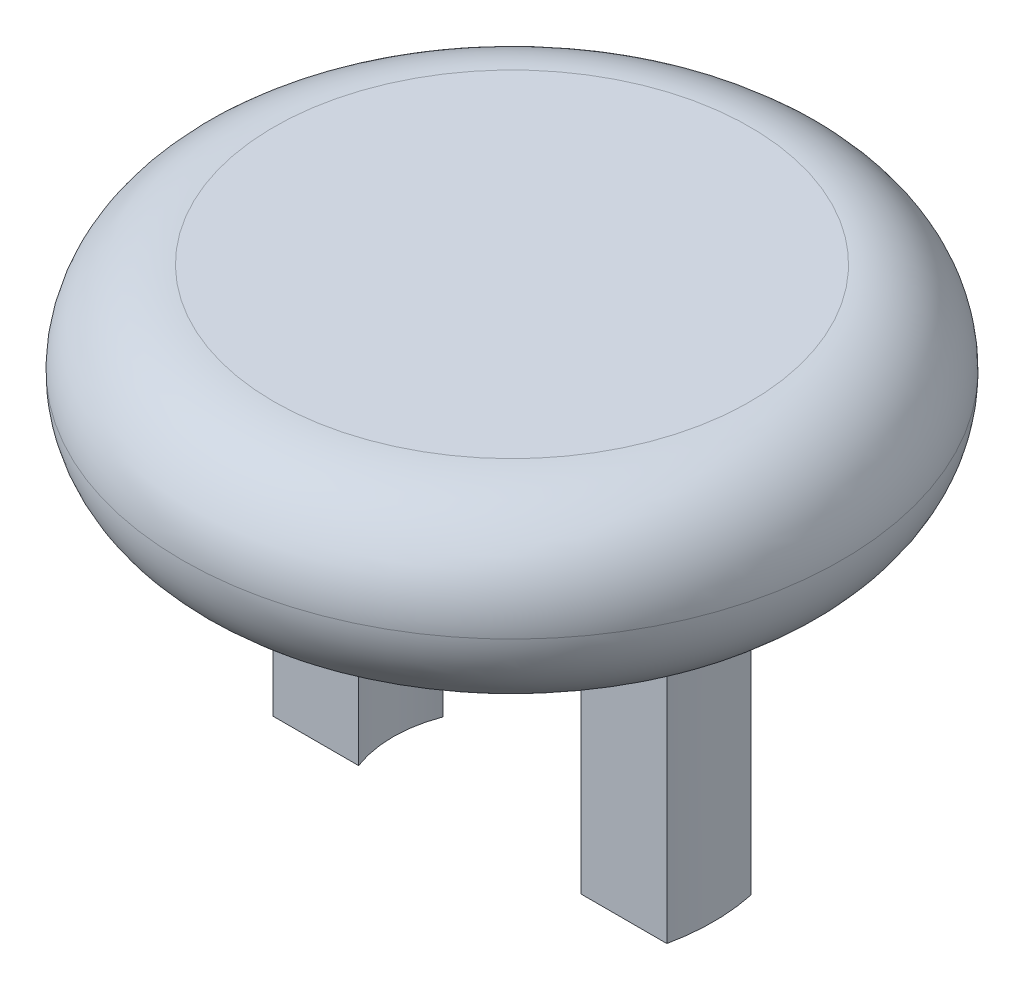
ISO-10303-21;
HEADER;
FILE_DESCRIPTION(('STEP AP214'),'2;1');
FILE_NAME('part.step','',(''),(''),'','','');
FILE_SCHEMA(('AUTOMOTIVE_DESIGN { 1 0 10303 214 1 1 1 1 }'));
ENDSEC;
DATA;
#1=APPLICATION_CONTEXT('core data for automotive mechanical design processes');
#2=APPLICATION_PROTOCOL_DEFINITION('international standard','automotive_design',2000,#1);
#3=PRODUCT_CONTEXT('',#1,'mechanical');
#4=PRODUCT('Part','Part','',(#3));
#5=PRODUCT_RELATED_PRODUCT_CATEGORY('part','',(#4));
#6=PRODUCT_DEFINITION_FORMATION('','',#4);
#7=PRODUCT_DEFINITION_CONTEXT('part definition',#1,'design');
#8=PRODUCT_DEFINITION('design','',#6,#7);
#9=PRODUCT_DEFINITION_SHAPE('','',#8);
#10=(LENGTH_UNIT() NAMED_UNIT(*) SI_UNIT(.MILLI.,.METRE.));
#11=(NAMED_UNIT(*) PLANE_ANGLE_UNIT() SI_UNIT($,.RADIAN.));
#12=(NAMED_UNIT(*) SI_UNIT($,.STERADIAN.) SOLID_ANGLE_UNIT());
#13=UNCERTAINTY_MEASURE_WITH_UNIT(LENGTH_MEASURE(1.E-05),#10,'distance_accuracy_value','');
#14=(GEOMETRIC_REPRESENTATION_CONTEXT(3) GLOBAL_UNCERTAINTY_ASSIGNED_CONTEXT((#13)) GLOBAL_UNIT_ASSIGNED_CONTEXT((#10,
#11,#12)) REPRESENTATION_CONTEXT('',''));
#15=CARTESIAN_POINT('',(0.,0.,0.));
#16=DIRECTION('',(0.,0.,1.));
#17=DIRECTION('',(1.,0.,0.));
#18=AXIS2_PLACEMENT_3D('',#15,#16,#17);
#19=CARTESIAN_POINT('',(0.,-0.3,0.));
#20=DIRECTION('',(0.,-1.,0.));
#21=DIRECTION('',(0.,0.,-1.));
#22=AXIS2_PLACEMENT_3D('',#19,#20,#21);
#23=PLANE('',#22);
#24=CARTESIAN_POINT('',(0.,-0.3,0.));
#25=DIRECTION('',(0.,-1.,0.));
#26=DIRECTION('',(0.,0.,-1.));
#27=AXIS2_PLACEMENT_3D('',#24,#25,#26);
#28=CIRCLE('',#27,3.25);
#29=CARTESIAN_POINT('',(3.03973683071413,-0.3,1.15));
#30=VERTEX_POINT('',#29);
#31=CARTESIAN_POINT('',(-3.03973683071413,-0.3,1.15));
#32=VERTEX_POINT('',#31);
#33=EDGE_CURVE('E59',#30,#32,#28,.T.);
#34=ORIENTED_EDGE('',*,*,#33,.F.);
#35=DIRECTION('',(-1.,0.,0.));
#36=VECTOR('',#35,1.);
#37=CARTESIAN_POINT('',(3.03973683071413,-0.3,1.15));
#38=LINE('',#37,#36);
#39=CARTESIAN_POINT('',(5.3784291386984,-0.3,1.15));
#40=VERTEX_POINT('',#39);
#41=EDGE_CURVE('E116',#40,#30,#38,.T.);
#42=ORIENTED_EDGE('',*,*,#41,.F.);
#43=CARTESIAN_POINT('',(0.,-0.3,0.));
#44=DIRECTION('',(0.,-1.,0.));
#45=DIRECTION('',(0.,0.,-1.));
#46=AXIS2_PLACEMENT_3D('',#43,#44,#45);
#47=CIRCLE('',#46,5.5);
#48=CARTESIAN_POINT('',(-5.3784291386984,-0.3,1.15));
#49=VERTEX_POINT('',#48);
#50=EDGE_CURVE('E40',#40,#49,#47,.T.);
#51=ORIENTED_EDGE('',*,*,#50,.T.);
#52=DIRECTION('',(-1.,0.,0.));
#53=VECTOR('',#52,1.);
#54=CARTESIAN_POINT('',(-5.3784291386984,-0.3,1.15));
#55=LINE('',#54,#53);
#56=EDGE_CURVE('E147',#32,#49,#55,.T.);
#57=ORIENTED_EDGE('',*,*,#56,.F.);
#58=EDGE_LOOP('',(#34,#42,#51,#57));
#59=FACE_BOUND('',#58,.T.);
#60=ADVANCED_FACE('F36',(#59),#23,.T.);
#61=CARTESIAN_POINT('',(-5.3784291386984,-0.3,-1.15));
#62=VERTEX_POINT('',#61);
#63=CARTESIAN_POINT('',(5.3784291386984,-0.3,-1.15));
#64=VERTEX_POINT('',#63);
#65=EDGE_CURVE('E187',#62,#64,#47,.T.);
#66=ORIENTED_EDGE('',*,*,#65,.T.);
#67=DIRECTION('',(1.,0.,0.));
#68=VECTOR('',#67,1.);
#69=CARTESIAN_POINT('',(3.03973683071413,-0.3,-1.15));
#70=LINE('',#69,#68);
#71=CARTESIAN_POINT('',(3.03973683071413,-0.3,-1.15));
#72=VERTEX_POINT('',#71);
#73=EDGE_CURVE('E119',#72,#64,#70,.T.);
#74=ORIENTED_EDGE('',*,*,#73,.F.);
#75=CARTESIAN_POINT('',(-3.03973683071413,-0.3,-1.15));
#76=VERTEX_POINT('',#75);
#77=EDGE_CURVE('E162',#76,#72,#28,.T.);
#78=ORIENTED_EDGE('',*,*,#77,.F.);
#79=DIRECTION('',(1.,0.,0.));
#80=VECTOR('',#79,1.);
#81=CARTESIAN_POINT('',(-5.3784291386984,-0.3,-1.15));
#82=LINE('',#81,#80);
#83=EDGE_CURVE('E142',#62,#76,#82,.T.);
#84=ORIENTED_EDGE('',*,*,#83,.F.);
#85=EDGE_LOOP('',(#66,#74,#78,#84));
#86=FACE_BOUND('',#85,.T.);
#87=ADVANCED_FACE('F224',(#86),#23,.T.);
#88=CARTESIAN_POINT('',(0.,0.,0.));
#89=DIRECTION('',(0.,1.,0.));
#90=DIRECTION('',(0.,0.,1.));
#91=AXIS2_PLACEMENT_3D('',#88,#89,#90);
#92=PLANE('',#91);
#93=CARTESIAN_POINT('',(0.,0.,0.));
#94=DIRECTION('',(0.,1.,0.));
#95=DIRECTION('',(0.,0.,1.));
#96=AXIS2_PLACEMENT_3D('',#93,#94,#95);
#97=CIRCLE('',#96,6.5);
#98=CARTESIAN_POINT('',(0.,0.,6.5));
#99=VERTEX_POINT('',#98);
#100=EDGE_CURVE('E196',#99,#99,#97,.F.);
#101=ORIENTED_EDGE('',*,*,#100,.T.);
#102=EDGE_LOOP('',(#101));
#103=FACE_BOUND('',#102,.T.);
#104=CARTESIAN_POINT('',(0.,0.,0.));
#105=DIRECTION('',(0.,1.,0.));
#106=DIRECTION('',(0.,0.,1.));
#107=AXIS2_PLACEMENT_3D('',#104,#105,#106);
#108=CIRCLE('',#107,5.5);
#109=CARTESIAN_POINT('',(0.,0.,5.5));
#110=VERTEX_POINT('',#109);
#111=EDGE_CURVE('E11',#110,#110,#108,.F.);
#112=ORIENTED_EDGE('',*,*,#111,.F.);
#113=EDGE_LOOP('',(#112));
#114=FACE_BOUND('',#113,.T.);
#115=ADVANCED_FACE('F216',(#103,#114),#92,.F.);
#116=CARTESIAN_POINT('',(0.,5.,0.));
#117=DIRECTION('',(0.,1.,0.));
#118=DIRECTION('',(0.,0.,1.));
#119=AXIS2_PLACEMENT_3D('',#116,#117,#118);
#120=PLANE('',#119);
#121=CARTESIAN_POINT('',(0.,5.,0.));
#122=DIRECTION('',(0.,1.,0.));
#123=DIRECTION('',(0.,0.,1.));
#124=AXIS2_PLACEMENT_3D('',#121,#122,#123);
#125=CIRCLE('',#124,6.5);
#126=CARTESIAN_POINT('',(0.,5.,6.5));
#127=VERTEX_POINT('',#126);
#128=EDGE_CURVE('E46',#127,#127,#125,.T.);
#129=ORIENTED_EDGE('',*,*,#128,.T.);
#130=EDGE_LOOP('',(#129));
#131=FACE_BOUND('',#130,.T.);
#132=ADVANCED_FACE('F231',(#131),#120,.T.);
#133=CARTESIAN_POINT('',(0.,2.5,0.));
#134=DIRECTION('',(0.,1.,0.));
#135=DIRECTION('',(0.,0.,1.));
#136=AXIS2_PLACEMENT_3D('',#133,#134,#135);
#137=TOROIDAL_SURFACE('',#136,6.5,2.5);
#138=ORIENTED_EDGE('',*,*,#128,.F.);
#139=EDGE_LOOP('',(#138));
#140=FACE_BOUND('',#139,.T.);
#141=CARTESIAN_POINT('',(0.,2.5,0.));
#142=DIRECTION('',(0.,1.,0.));
#143=DIRECTION('',(0.,0.,1.));
#144=AXIS2_PLACEMENT_3D('',#141,#142,#143);
#145=CIRCLE('',#144,9.);
#146=CARTESIAN_POINT('',(0.,2.5,9.));
#147=VERTEX_POINT('',#146);
#148=EDGE_CURVE('E190',#147,#147,#145,.F.);
#149=ORIENTED_EDGE('',*,*,#148,.F.);
#150=EDGE_LOOP('',(#149));
#151=FACE_BOUND('',#150,.T.);
#152=ADVANCED_FACE('F38',(#140,#151),#137,.T.);
#153=CARTESIAN_POINT('',(0.,2.5,0.));
#154=DIRECTION('',(0.,1.,0.));
#155=DIRECTION('',(0.,0.,1.));
#156=AXIS2_PLACEMENT_3D('',#153,#154,#155);
#157=TOROIDAL_SURFACE('',#156,6.5,2.5);
#158=ORIENTED_EDGE('',*,*,#100,.F.);
#159=EDGE_LOOP('',(#158));
#160=FACE_BOUND('',#159,.T.);
#161=ORIENTED_EDGE('',*,*,#148,.T.);
#162=EDGE_LOOP('',(#161));
#163=FACE_BOUND('',#162,.T.);
#164=ADVANCED_FACE('F217',(#160,#163),#157,.T.);
#165=CARTESIAN_POINT('',(0.,-0.3,0.));
#166=DIRECTION('',(0.,1.,0.));
#167=DIRECTION('',(0.,0.,1.));
#168=AXIS2_PLACEMENT_3D('',#165,#166,#167);
#169=CYLINDRICAL_SURFACE('',#168,5.5);
#170=ORIENTED_EDGE('',*,*,#65,.F.);
#171=DIRECTION('',(0.,1.,0.));
#172=VECTOR('',#171,1.);
#173=CARTESIAN_POINT('',(-5.3784291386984,-7.8,-1.15));
#174=LINE('',#173,#172);
#175=CARTESIAN_POINT('',(-5.3784291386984,-7.8,-1.15));
#176=VERTEX_POINT('',#175);
#177=EDGE_CURVE('E167',#176,#62,#174,.T.);
#178=ORIENTED_EDGE('',*,*,#177,.F.);
#179=CARTESIAN_POINT('',(0.,-7.8,0.));
#180=DIRECTION('',(0.,-1.,0.));
#181=DIRECTION('',(0.,0.,-1.));
#182=AXIS2_PLACEMENT_3D('',#179,#180,#181);
#183=CIRCLE('',#182,5.5);
#184=CARTESIAN_POINT('',(-5.3784291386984,-7.8,1.15));
#185=VERTEX_POINT('',#184);
#186=EDGE_CURVE('E143',#185,#176,#183,.T.);
#187=ORIENTED_EDGE('',*,*,#186,.F.);
#188=DIRECTION('',(0.,1.,0.));
#189=VECTOR('',#188,1.);
#190=CARTESIAN_POINT('',(-5.3784291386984,-7.8,1.15));
#191=LINE('',#190,#189);
#192=EDGE_CURVE('E153',#185,#49,#191,.T.);
#193=ORIENTED_EDGE('',*,*,#192,.T.);
#194=ORIENTED_EDGE('',*,*,#50,.F.);
#195=DIRECTION('',(0.,1.,0.));
#196=VECTOR('',#195,1.);
#197=CARTESIAN_POINT('',(5.3784291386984,-7.8,1.15));
#198=LINE('',#197,#196);
#199=CARTESIAN_POINT('',(5.3784291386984,-7.8,1.15));
#200=VERTEX_POINT('',#199);
#201=EDGE_CURVE('E140',#200,#40,#198,.T.);
#202=ORIENTED_EDGE('',*,*,#201,.F.);
#203=CARTESIAN_POINT('',(0.,-7.8,0.));
#204=DIRECTION('',(0.,-1.,0.));
#205=DIRECTION('',(0.,0.,-1.));
#206=AXIS2_PLACEMENT_3D('',#203,#204,#205);
#207=CIRCLE('',#206,5.5);
#208=CARTESIAN_POINT('',(5.3784291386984,-7.8,-1.15));
#209=VERTEX_POINT('',#208);
#210=EDGE_CURVE('E124',#209,#200,#207,.T.);
#211=ORIENTED_EDGE('',*,*,#210,.F.);
#212=DIRECTION('',(0.,1.,0.));
#213=VECTOR('',#212,1.);
#214=CARTESIAN_POINT('',(5.3784291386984,-7.8,-1.15));
#215=LINE('',#214,#213);
#216=EDGE_CURVE('E132',#209,#64,#215,.T.);
#217=ORIENTED_EDGE('',*,*,#216,.T.);
#218=EDGE_LOOP('',(#170,#178,#187,#193,#194,#202,#211,#217));
#219=FACE_BOUND('',#218,.T.);
#220=ORIENTED_EDGE('',*,*,#111,.T.);
#221=EDGE_LOOP('',(#220));
#222=FACE_BOUND('',#221,.T.);
#223=ADVANCED_FACE('F207',(#219,#222),#169,.T.);
#224=CARTESIAN_POINT('',(0.,-0.3,0.));
#225=DIRECTION('',(0.,1.,0.));
#226=DIRECTION('',(0.,0.,1.));
#227=AXIS2_PLACEMENT_3D('',#224,#225,#226);
#228=CYLINDRICAL_SURFACE('',#227,3.25);
#229=ORIENTED_EDGE('',*,*,#77,.T.);
#230=DIRECTION('',(0.,1.,0.));
#231=VECTOR('',#230,1.);
#232=CARTESIAN_POINT('',(3.03973683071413,-7.8,-1.15));
#233=LINE('',#232,#231);
#234=CARTESIAN_POINT('',(3.03973683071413,-7.8,-1.15));
#235=VERTEX_POINT('',#234);
#236=EDGE_CURVE('E137',#235,#72,#233,.T.);
#237=ORIENTED_EDGE('',*,*,#236,.F.);
#238=CARTESIAN_POINT('',(0.,-7.8,0.));
#239=DIRECTION('',(0.,1.,0.));
#240=DIRECTION('',(0.,0.,-1.));
#241=AXIS2_PLACEMENT_3D('',#238,#239,#240);
#242=CIRCLE('',#241,3.25);
#243=CARTESIAN_POINT('',(3.03973683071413,-7.8,1.15));
#244=VERTEX_POINT('',#243);
#245=EDGE_CURVE('E129',#244,#235,#242,.T.);
#246=ORIENTED_EDGE('',*,*,#245,.F.);
#247=DIRECTION('',(0.,1.,0.));
#248=VECTOR('',#247,1.);
#249=CARTESIAN_POINT('',(3.03973683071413,-7.8,1.15));
#250=LINE('',#249,#248);
#251=EDGE_CURVE('E54',#244,#30,#250,.T.);
#252=ORIENTED_EDGE('',*,*,#251,.T.);
#253=ORIENTED_EDGE('',*,*,#33,.T.);
#254=DIRECTION('',(0.,1.,0.));
#255=VECTOR('',#254,1.);
#256=CARTESIAN_POINT('',(-3.03973683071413,-7.8,1.15));
#257=LINE('',#256,#255);
#258=CARTESIAN_POINT('',(-3.03973683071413,-7.8,1.15));
#259=VERTEX_POINT('',#258);
#260=EDGE_CURVE('E168',#259,#32,#257,.T.);
#261=ORIENTED_EDGE('',*,*,#260,.F.);
#262=CARTESIAN_POINT('',(0.,-7.8,0.));
#263=DIRECTION('',(0.,1.,0.));
#264=DIRECTION('',(0.,0.,-1.));
#265=AXIS2_PLACEMENT_3D('',#262,#263,#264);
#266=CIRCLE('',#265,3.25);
#267=CARTESIAN_POINT('',(-3.03973683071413,-7.8,-1.15));
#268=VERTEX_POINT('',#267);
#269=EDGE_CURVE('E149',#268,#259,#266,.T.);
#270=ORIENTED_EDGE('',*,*,#269,.F.);
#271=DIRECTION('',(0.,1.,0.));
#272=VECTOR('',#271,1.);
#273=CARTESIAN_POINT('',(-3.03973683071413,-7.8,-1.15));
#274=LINE('',#273,#272);
#275=EDGE_CURVE('E164',#268,#76,#274,.T.);
#276=ORIENTED_EDGE('',*,*,#275,.T.);
#277=EDGE_LOOP('',(#229,#237,#246,#252,#253,#261,#270,#276));
#278=FACE_BOUND('',#277,.T.);
#279=CARTESIAN_POINT('',(0.,0.,0.));
#280=DIRECTION('',(0.,-1.,0.));
#281=DIRECTION('',(0.,0.,-1.));
#282=AXIS2_PLACEMENT_3D('',#279,#280,#281);
#283=CIRCLE('',#282,3.25);
#284=CARTESIAN_POINT('',(0.,0.,-3.25));
#285=VERTEX_POINT('',#284);
#286=EDGE_CURVE('E173',#285,#285,#283,.T.);
#287=ORIENTED_EDGE('',*,*,#286,.F.);
#288=EDGE_LOOP('',(#287));
#289=FACE_BOUND('',#288,.T.);
#290=ADVANCED_FACE('F205',(#278,#289),#228,.F.);
#291=CARTESIAN_POINT('',(0.,0.,0.));
#292=DIRECTION('',(0.,-1.,0.));
#293=DIRECTION('',(0.,0.,-1.));
#294=AXIS2_PLACEMENT_3D('',#291,#292,#293);
#295=CIRCLE('',#294,1.65);
#296=CARTESIAN_POINT('',(0.,0.,-1.65));
#297=VERTEX_POINT('',#296);
#298=EDGE_CURVE('E117',#297,#297,#295,.T.);
#299=ORIENTED_EDGE('',*,*,#298,.F.);
#300=EDGE_LOOP('',(#299));
#301=FACE_BOUND('',#300,.T.);
#302=ORIENTED_EDGE('',*,*,#286,.T.);
#303=EDGE_LOOP('',(#302));
#304=FACE_BOUND('',#303,.T.);
#305=ADVANCED_FACE('F203',(#301,#304),#92,.F.);
#306=CARTESIAN_POINT('',(-5.3784291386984,-7.8,-1.15));
#307=DIRECTION('',(0.,0.,1.));
#308=DIRECTION('',(1.,0.,0.));
#309=AXIS2_PLACEMENT_3D('',#306,#307,#308);
#310=PLANE('',#309);
#311=ORIENTED_EDGE('',*,*,#83,.T.);
#312=ORIENTED_EDGE('',*,*,#275,.F.);
#313=DIRECTION('',(1.,0.,0.));
#314=VECTOR('',#313,1.);
#315=CARTESIAN_POINT('',(-5.3784291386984,-7.8,-1.15));
#316=LINE('',#315,#314);
#317=EDGE_CURVE('E146',#176,#268,#316,.T.);
#318=ORIENTED_EDGE('',*,*,#317,.F.);
#319=ORIENTED_EDGE('',*,*,#177,.T.);
#320=EDGE_LOOP('',(#311,#312,#318,#319));
#321=FACE_BOUND('',#320,.T.);
#322=ADVANCED_FACE('F213',(#321),#310,.F.);
#323=CARTESIAN_POINT('',(-5.3784291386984,-7.8,1.15));
#324=DIRECTION('',(0.,0.,-1.));
#325=DIRECTION('',(-1.,0.,0.));
#326=AXIS2_PLACEMENT_3D('',#323,#324,#325);
#327=PLANE('',#326);
#328=ORIENTED_EDGE('',*,*,#56,.T.);
#329=ORIENTED_EDGE('',*,*,#192,.F.);
#330=DIRECTION('',(-1.,0.,0.));
#331=VECTOR('',#330,1.);
#332=CARTESIAN_POINT('',(-5.3784291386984,-7.8,1.15));
#333=LINE('',#332,#331);
#334=EDGE_CURVE('E151',#259,#185,#333,.T.);
#335=ORIENTED_EDGE('',*,*,#334,.F.);
#336=ORIENTED_EDGE('',*,*,#260,.T.);
#337=EDGE_LOOP('',(#328,#329,#335,#336));
#338=FACE_BOUND('',#337,.T.);
#339=ADVANCED_FACE('F307',(#338),#327,.F.);
#340=CARTESIAN_POINT('',(0.,-7.8,0.));
#341=DIRECTION('',(0.,-1.,0.));
#342=DIRECTION('',(0.,0.,-1.));
#343=AXIS2_PLACEMENT_3D('',#340,#341,#342);
#344=PLANE('',#343);
#345=ORIENTED_EDGE('',*,*,#186,.T.);
#346=ORIENTED_EDGE('',*,*,#317,.T.);
#347=ORIENTED_EDGE('',*,*,#269,.T.);
#348=ORIENTED_EDGE('',*,*,#334,.T.);
#349=EDGE_LOOP('',(#345,#346,#347,#348));
#350=FACE_BOUND('',#349,.T.);
#351=ADVANCED_FACE('F316',(#350),#344,.T.);
#352=CARTESIAN_POINT('',(3.03973683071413,-7.8,1.15));
#353=DIRECTION('',(0.,0.,-1.));
#354=DIRECTION('',(-1.,0.,0.));
#355=AXIS2_PLACEMENT_3D('',#352,#353,#354);
#356=PLANE('',#355);
#357=ORIENTED_EDGE('',*,*,#41,.T.);
#358=ORIENTED_EDGE('',*,*,#251,.F.);
#359=DIRECTION('',(-1.,0.,0.));
#360=VECTOR('',#359,1.);
#361=CARTESIAN_POINT('',(3.03973683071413,-7.8,1.15));
#362=LINE('',#361,#360);
#363=EDGE_CURVE('E127',#200,#244,#362,.T.);
#364=ORIENTED_EDGE('',*,*,#363,.F.);
#365=ORIENTED_EDGE('',*,*,#201,.T.);
#366=EDGE_LOOP('',(#357,#358,#364,#365));
#367=FACE_BOUND('',#366,.T.);
#368=ADVANCED_FACE('F326',(#367),#356,.F.);
#369=CARTESIAN_POINT('',(3.03973683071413,-7.8,-1.15));
#370=DIRECTION('',(0.,0.,1.));
#371=DIRECTION('',(1.,0.,0.));
#372=AXIS2_PLACEMENT_3D('',#369,#370,#371);
#373=PLANE('',#372);
#374=ORIENTED_EDGE('',*,*,#73,.T.);
#375=ORIENTED_EDGE('',*,*,#216,.F.);
#376=DIRECTION('',(1.,0.,0.));
#377=VECTOR('',#376,1.);
#378=CARTESIAN_POINT('',(3.03973683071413,-7.8,-1.15));
#379=LINE('',#378,#377);
#380=EDGE_CURVE('E131',#235,#209,#379,.T.);
#381=ORIENTED_EDGE('',*,*,#380,.F.);
#382=ORIENTED_EDGE('',*,*,#236,.T.);
#383=EDGE_LOOP('',(#374,#375,#381,#382));
#384=FACE_BOUND('',#383,.T.);
#385=ADVANCED_FACE('F336',(#384),#373,.F.);
#386=CARTESIAN_POINT('',(0.,-7.8,0.));
#387=DIRECTION('',(0.,-1.,0.));
#388=DIRECTION('',(0.,0.,-1.));
#389=AXIS2_PLACEMENT_3D('',#386,#387,#388);
#390=PLANE('',#389);
#391=ORIENTED_EDGE('',*,*,#210,.T.);
#392=ORIENTED_EDGE('',*,*,#363,.T.);
#393=ORIENTED_EDGE('',*,*,#245,.T.);
#394=ORIENTED_EDGE('',*,*,#380,.T.);
#395=EDGE_LOOP('',(#391,#392,#393,#394));
#396=FACE_BOUND('',#395,.T.);
#397=ADVANCED_FACE('F110',(#396),#390,.T.);
#398=CARTESIAN_POINT('',(0.,4.,0.));
#399=DIRECTION('',(0.,-1.,0.));
#400=DIRECTION('',(0.,0.,-1.));
#401=AXIS2_PLACEMENT_3D('',#398,#399,#400);
#402=CONICAL_SURFACE('',#401,1.65,1.22173047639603);
#403=CARTESIAN_POINT('',(0.,4.60055088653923,0.));
#404=VERTEX_POINT('',#403);
#405=VERTEX_LOOP('',#404);
#406=FACE_BOUND('',#405,.T.);
#407=CARTESIAN_POINT('',(0.,4.,0.));
#408=DIRECTION('',(0.,-1.,0.));
#409=DIRECTION('',(0.,0.,-1.));
#410=AXIS2_PLACEMENT_3D('',#407,#408,#409);
#411=CIRCLE('',#410,1.65);
#412=CARTESIAN_POINT('',(0.,4.,-1.65));
#413=VERTEX_POINT('',#412);
#414=EDGE_CURVE('E114',#413,#413,#411,.T.);
#415=ORIENTED_EDGE('',*,*,#414,.T.);
#416=EDGE_LOOP('',(#415));
#417=FACE_BOUND('',#416,.T.);
#418=ADVANCED_FACE('F106',(#406,#417),#402,.F.);
#419=CARTESIAN_POINT('',(0.,0.,0.));
#420=DIRECTION('',(0.,-1.,0.));
#421=DIRECTION('',(0.,0.,-1.));
#422=AXIS2_PLACEMENT_3D('',#419,#420,#421);
#423=CYLINDRICAL_SURFACE('',#422,1.65);
#424=ORIENTED_EDGE('',*,*,#414,.F.);
#425=EDGE_LOOP('',(#424));
#426=FACE_BOUND('',#425,.T.);
#427=ORIENTED_EDGE('',*,*,#298,.T.);
#428=EDGE_LOOP('',(#427));
#429=FACE_BOUND('',#428,.T.);
#430=ADVANCED_FACE('F109',(#426,#429),#423,.F.);
#431=CLOSED_SHELL('',(#60,#87,#115,#132,#152,#164,#223,#290,#305,#322,#339,#351,#368,#385,#397,
#418,#430));
#432=MANIFOLD_SOLID_BREP('B2',#431);
#433=ADVANCED_BREP_SHAPE_REPRESENTATION('',(#18,#432),#14);
#434=SHAPE_DEFINITION_REPRESENTATION(#9,#433);
ENDSEC;
END-ISO-10303-21;
